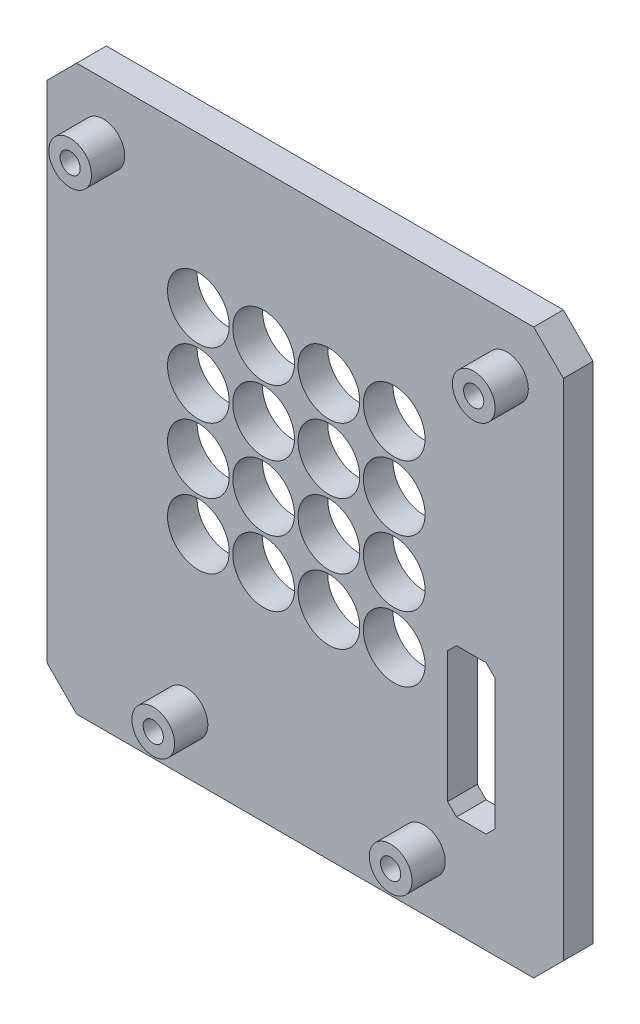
ISO-10303-21;
HEADER;
FILE_DESCRIPTION(('STEP AP214'),'2;1');
FILE_NAME('part.step','',(''),(''),'','','');
FILE_SCHEMA(('AUTOMOTIVE_DESIGN { 1 0 10303 214 1 1 1 1 }'));
ENDSEC;
DATA;
#1=APPLICATION_CONTEXT('core data for automotive mechanical design processes');
#2=APPLICATION_PROTOCOL_DEFINITION('international standard','automotive_design',2000,#1);
#3=PRODUCT_CONTEXT('',#1,'mechanical');
#4=PRODUCT('Part','Part','',(#3));
#5=PRODUCT_RELATED_PRODUCT_CATEGORY('part','',(#4));
#6=PRODUCT_DEFINITION_FORMATION('','',#4);
#7=PRODUCT_DEFINITION_CONTEXT('part definition',#1,'design');
#8=PRODUCT_DEFINITION('design','',#6,#7);
#9=PRODUCT_DEFINITION_SHAPE('','',#8);
#10=(LENGTH_UNIT() NAMED_UNIT(*) SI_UNIT(.MILLI.,.METRE.));
#11=(NAMED_UNIT(*) PLANE_ANGLE_UNIT() SI_UNIT($,.RADIAN.));
#12=(NAMED_UNIT(*) SI_UNIT($,.STERADIAN.) SOLID_ANGLE_UNIT());
#13=UNCERTAINTY_MEASURE_WITH_UNIT(LENGTH_MEASURE(1.E-05),#10,'distance_accuracy_value','');
#14=(GEOMETRIC_REPRESENTATION_CONTEXT(3) GLOBAL_UNCERTAINTY_ASSIGNED_CONTEXT((#13)) GLOBAL_UNIT_ASSIGNED_CONTEXT((#10,
#11,#12)) REPRESENTATION_CONTEXT('',''));
#15=CARTESIAN_POINT('',(0.,0.,0.));
#16=DIRECTION('',(0.,0.,1.));
#17=DIRECTION('',(1.,0.,0.));
#18=AXIS2_PLACEMENT_3D('',#15,#16,#17);
#19=CARTESIAN_POINT('',(0.,0.,5.));
#20=DIRECTION('',(0.,0.,1.));
#21=DIRECTION('',(1.,0.,0.));
#22=AXIS2_PLACEMENT_3D('',#19,#20,#21);
#23=PLANE('',#22);
#24=CARTESIAN_POINT('',(21.5,-43.5,5.));
#25=DIRECTION('',(0.,0.,1.));
#26=DIRECTION('',(1.,0.,0.));
#27=AXIS2_PLACEMENT_3D('',#24,#25,#26);
#28=CIRCLE('',#27,3.6);
#29=CARTESIAN_POINT('',(25.1,-43.5,5.));
#30=VERTEX_POINT('',#29);
#31=EDGE_CURVE('E615',#30,#30,#28,.T.);
#32=ORIENTED_EDGE('',*,*,#31,.F.);
#33=EDGE_LOOP('',(#32));
#34=FACE_BOUND('',#33,.T.);
#35=CARTESIAN_POINT('',(35.5,32.5,5.));
#36=DIRECTION('',(0.,0.,1.));
#37=DIRECTION('',(1.,0.,0.));
#38=AXIS2_PLACEMENT_3D('',#35,#36,#37);
#39=CIRCLE('',#38,3.6);
#40=CARTESIAN_POINT('',(39.1,32.5,5.));
#41=VERTEX_POINT('',#40);
#42=EDGE_CURVE('E611',#41,#41,#39,.T.);
#43=ORIENTED_EDGE('',*,*,#42,.F.);
#44=EDGE_LOOP('',(#43));
#45=FACE_BOUND('',#44,.T.);
#46=CARTESIAN_POINT('',(5.5,16.5,5.));
#47=DIRECTION('',(0.,0.,1.));
#48=DIRECTION('',(1.,0.,0.));
#49=AXIS2_PLACEMENT_3D('',#46,#47,#48);
#50=CIRCLE('',#49,5.2);
#51=CARTESIAN_POINT('',(10.7,16.5,5.));
#52=VERTEX_POINT('',#51);
#53=EDGE_CURVE('E242',#52,#52,#50,.T.);
#54=ORIENTED_EDGE('',*,*,#53,.F.);
#55=EDGE_LOOP('',(#54));
#56=FACE_BOUND('',#55,.T.);
#57=CARTESIAN_POINT('',(-16.5,16.5,5.));
#58=DIRECTION('',(0.,0.,1.));
#59=DIRECTION('',(1.,0.,0.));
#60=AXIS2_PLACEMENT_3D('',#57,#58,#59);
#61=CIRCLE('',#60,5.2);
#62=CARTESIAN_POINT('',(-11.3,16.5,5.));
#63=VERTEX_POINT('',#62);
#64=EDGE_CURVE('E254',#63,#63,#61,.T.);
#65=ORIENTED_EDGE('',*,*,#64,.F.);
#66=EDGE_LOOP('',(#65));
#67=FACE_BOUND('',#66,.T.);
#68=CARTESIAN_POINT('',(5.5,5.5,5.));
#69=DIRECTION('',(0.,0.,1.));
#70=DIRECTION('',(1.,0.,0.));
#71=AXIS2_PLACEMENT_3D('',#68,#69,#70);
#72=CIRCLE('',#71,5.2);
#73=CARTESIAN_POINT('',(10.7,5.5,5.));
#74=VERTEX_POINT('',#73);
#75=EDGE_CURVE('E266',#74,#74,#72,.T.);
#76=ORIENTED_EDGE('',*,*,#75,.F.);
#77=EDGE_LOOP('',(#76));
#78=FACE_BOUND('',#77,.T.);
#79=CARTESIAN_POINT('',(-16.5,5.5,5.));
#80=DIRECTION('',(0.,0.,1.));
#81=DIRECTION('',(1.,0.,0.));
#82=AXIS2_PLACEMENT_3D('',#79,#80,#81);
#83=CIRCLE('',#82,5.2);
#84=CARTESIAN_POINT('',(-11.3,5.5,5.));
#85=VERTEX_POINT('',#84);
#86=EDGE_CURVE('E278',#85,#85,#83,.T.);
#87=ORIENTED_EDGE('',*,*,#86,.F.);
#88=EDGE_LOOP('',(#87));
#89=FACE_BOUND('',#88,.T.);
#90=CARTESIAN_POINT('',(5.5,-5.5,5.));
#91=DIRECTION('',(0.,0.,1.));
#92=DIRECTION('',(1.,0.,0.));
#93=AXIS2_PLACEMENT_3D('',#90,#91,#92);
#94=CIRCLE('',#93,5.2);
#95=CARTESIAN_POINT('',(10.7,-5.5,5.));
#96=VERTEX_POINT('',#95);
#97=EDGE_CURVE('E290',#96,#96,#94,.T.);
#98=ORIENTED_EDGE('',*,*,#97,.F.);
#99=EDGE_LOOP('',(#98));
#100=FACE_BOUND('',#99,.T.);
#101=CARTESIAN_POINT('',(-16.5,-5.5,5.));
#102=DIRECTION('',(0.,0.,1.));
#103=DIRECTION('',(1.,0.,0.));
#104=AXIS2_PLACEMENT_3D('',#101,#102,#103);
#105=CIRCLE('',#104,5.2);
#106=CARTESIAN_POINT('',(-11.3,-5.5,5.));
#107=VERTEX_POINT('',#106);
#108=EDGE_CURVE('E302',#107,#107,#105,.T.);
#109=ORIENTED_EDGE('',*,*,#108,.F.);
#110=EDGE_LOOP('',(#109));
#111=FACE_BOUND('',#110,.T.);
#112=CARTESIAN_POINT('',(5.5,-16.5,5.));
#113=DIRECTION('',(0.,0.,1.));
#114=DIRECTION('',(1.,0.,0.));
#115=AXIS2_PLACEMENT_3D('',#112,#113,#114);
#116=CIRCLE('',#115,5.2);
#117=CARTESIAN_POINT('',(10.7,-16.5,5.));
#118=VERTEX_POINT('',#117);
#119=EDGE_CURVE('E314',#118,#118,#116,.T.);
#120=ORIENTED_EDGE('',*,*,#119,.F.);
#121=EDGE_LOOP('',(#120));
#122=FACE_BOUND('',#121,.T.);
#123=CARTESIAN_POINT('',(-16.5,-16.5,5.));
#124=DIRECTION('',(0.,0.,1.));
#125=DIRECTION('',(1.,0.,0.));
#126=AXIS2_PLACEMENT_3D('',#123,#124,#125);
#127=CIRCLE('',#126,5.2);
#128=CARTESIAN_POINT('',(-11.3,-16.5,5.));
#129=VERTEX_POINT('',#128);
#130=EDGE_CURVE('E326',#129,#129,#127,.T.);
#131=ORIENTED_EDGE('',*,*,#130,.F.);
#132=EDGE_LOOP('',(#131));
#133=FACE_BOUND('',#132,.T.);
#134=DIRECTION('',(0.707106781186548,-0.707106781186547,0.));
#135=VECTOR('',#134,1.);
#136=CARTESIAN_POINT('',(-42.,-48.,5.));
#137=LINE('',#136,#135);
#138=CARTESIAN_POINT('',(-42.,-48.,5.));
#139=VERTEX_POINT('',#138);
#140=CARTESIAN_POINT('',(-37.,-53.,5.));
#141=VERTEX_POINT('',#140);
#142=EDGE_CURVE('E332',#139,#141,#137,.T.);
#143=ORIENTED_EDGE('',*,*,#142,.T.);
#144=DIRECTION('',(1.,0.,0.));
#145=VECTOR('',#144,1.);
#146=CARTESIAN_POINT('',(-37.,-53.,5.));
#147=LINE('',#146,#145);
#148=CARTESIAN_POINT('',(40.,-53.,5.));
#149=VERTEX_POINT('',#148);
#150=EDGE_CURVE('E335',#141,#149,#147,.T.);
#151=ORIENTED_EDGE('',*,*,#150,.T.);
#152=DIRECTION('',(0.707106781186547,0.707106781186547,0.));
#153=VECTOR('',#152,1.);
#154=CARTESIAN_POINT('',(40.,-53.,5.));
#155=LINE('',#154,#153);
#156=CARTESIAN_POINT('',(45.,-48.,5.));
#157=VERTEX_POINT('',#156);
#158=EDGE_CURVE('E338',#149,#157,#155,.T.);
#159=ORIENTED_EDGE('',*,*,#158,.T.);
#160=DIRECTION('',(0.,1.,0.));
#161=VECTOR('',#160,1.);
#162=CARTESIAN_POINT('',(45.,-48.,5.));
#163=LINE('',#162,#161);
#164=CARTESIAN_POINT('',(45.,37.,5.));
#165=VERTEX_POINT('',#164);
#166=EDGE_CURVE('E340',#157,#165,#163,.T.);
#167=ORIENTED_EDGE('',*,*,#166,.T.);
#168=DIRECTION('',(-0.707106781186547,0.707106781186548,0.));
#169=VECTOR('',#168,1.);
#170=CARTESIAN_POINT('',(45.,37.,5.));
#171=LINE('',#170,#169);
#172=CARTESIAN_POINT('',(40.,42.,5.));
#173=VERTEX_POINT('',#172);
#174=EDGE_CURVE('E342',#165,#173,#171,.T.);
#175=ORIENTED_EDGE('',*,*,#174,.T.);
#176=DIRECTION('',(-1.,0.,0.));
#177=VECTOR('',#176,1.);
#178=CARTESIAN_POINT('',(40.,42.,5.));
#179=LINE('',#178,#177);
#180=CARTESIAN_POINT('',(-37.,42.,5.));
#181=VERTEX_POINT('',#180);
#182=EDGE_CURVE('E344',#173,#181,#179,.T.);
#183=ORIENTED_EDGE('',*,*,#182,.T.);
#184=DIRECTION('',(-0.707106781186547,-0.707106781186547,0.));
#185=VECTOR('',#184,1.);
#186=CARTESIAN_POINT('',(-37.,42.,5.));
#187=LINE('',#186,#185);
#188=CARTESIAN_POINT('',(-42.,37.,5.));
#189=VERTEX_POINT('',#188);
#190=EDGE_CURVE('E346',#181,#189,#187,.T.);
#191=ORIENTED_EDGE('',*,*,#190,.T.);
#192=DIRECTION('',(0.,-1.,0.));
#193=VECTOR('',#192,1.);
#194=CARTESIAN_POINT('',(-42.,37.,5.));
#195=LINE('',#194,#193);
#196=EDGE_CURVE('E348',#189,#139,#195,.T.);
#197=ORIENTED_EDGE('',*,*,#196,.T.);
#198=EDGE_LOOP('',(#143,#151,#159,#167,#175,#183,#191,#197));
#199=FACE_BOUND('',#198,.T.);
#200=CARTESIAN_POINT('',(-5.5,-16.5,5.));
#201=DIRECTION('',(0.,0.,1.));
#202=DIRECTION('',(1.,0.,0.));
#203=AXIS2_PLACEMENT_3D('',#200,#201,#202);
#204=CIRCLE('',#203,5.2);
#205=CARTESIAN_POINT('',(-0.3,-16.5,5.));
#206=VERTEX_POINT('',#205);
#207=EDGE_CURVE('E320',#206,#206,#204,.T.);
#208=ORIENTED_EDGE('',*,*,#207,.F.);
#209=EDGE_LOOP('',(#208));
#210=FACE_BOUND('',#209,.T.);
#211=CARTESIAN_POINT('',(16.5,-16.5,5.));
#212=DIRECTION('',(0.,0.,1.));
#213=DIRECTION('',(1.,0.,0.));
#214=AXIS2_PLACEMENT_3D('',#211,#212,#213);
#215=CIRCLE('',#214,5.2);
#216=CARTESIAN_POINT('',(21.7,-16.5,5.));
#217=VERTEX_POINT('',#216);
#218=EDGE_CURVE('E308',#217,#217,#215,.T.);
#219=ORIENTED_EDGE('',*,*,#218,.F.);
#220=EDGE_LOOP('',(#219));
#221=FACE_BOUND('',#220,.T.);
#222=CARTESIAN_POINT('',(-5.5,-5.5,5.));
#223=DIRECTION('',(0.,0.,1.));
#224=DIRECTION('',(1.,0.,0.));
#225=AXIS2_PLACEMENT_3D('',#222,#223,#224);
#226=CIRCLE('',#225,5.2);
#227=CARTESIAN_POINT('',(-0.3,-5.5,5.));
#228=VERTEX_POINT('',#227);
#229=EDGE_CURVE('E296',#228,#228,#226,.T.);
#230=ORIENTED_EDGE('',*,*,#229,.F.);
#231=EDGE_LOOP('',(#230));
#232=FACE_BOUND('',#231,.T.);
#233=CARTESIAN_POINT('',(16.5,-5.5,5.));
#234=DIRECTION('',(0.,0.,1.));
#235=DIRECTION('',(1.,0.,0.));
#236=AXIS2_PLACEMENT_3D('',#233,#234,#235);
#237=CIRCLE('',#236,5.2);
#238=CARTESIAN_POINT('',(21.7,-5.5,5.));
#239=VERTEX_POINT('',#238);
#240=EDGE_CURVE('E284',#239,#239,#237,.T.);
#241=ORIENTED_EDGE('',*,*,#240,.F.);
#242=EDGE_LOOP('',(#241));
#243=FACE_BOUND('',#242,.T.);
#244=CARTESIAN_POINT('',(-5.5,5.5,5.));
#245=DIRECTION('',(0.,0.,1.));
#246=DIRECTION('',(1.,0.,0.));
#247=AXIS2_PLACEMENT_3D('',#244,#245,#246);
#248=CIRCLE('',#247,5.2);
#249=CARTESIAN_POINT('',(-0.3,5.5,5.));
#250=VERTEX_POINT('',#249);
#251=EDGE_CURVE('E272',#250,#250,#248,.T.);
#252=ORIENTED_EDGE('',*,*,#251,.F.);
#253=EDGE_LOOP('',(#252));
#254=FACE_BOUND('',#253,.T.);
#255=CARTESIAN_POINT('',(16.5,5.5,5.));
#256=DIRECTION('',(0.,0.,1.));
#257=DIRECTION('',(1.,0.,0.));
#258=AXIS2_PLACEMENT_3D('',#255,#256,#257);
#259=CIRCLE('',#258,5.2);
#260=CARTESIAN_POINT('',(21.7,5.5,5.));
#261=VERTEX_POINT('',#260);
#262=EDGE_CURVE('E260',#261,#261,#259,.T.);
#263=ORIENTED_EDGE('',*,*,#262,.F.);
#264=EDGE_LOOP('',(#263));
#265=FACE_BOUND('',#264,.T.);
#266=CARTESIAN_POINT('',(-5.5,16.5,5.));
#267=DIRECTION('',(0.,0.,1.));
#268=DIRECTION('',(1.,0.,0.));
#269=AXIS2_PLACEMENT_3D('',#266,#267,#268);
#270=CIRCLE('',#269,5.2);
#271=CARTESIAN_POINT('',(-0.3,16.5,5.));
#272=VERTEX_POINT('',#271);
#273=EDGE_CURVE('E248',#272,#272,#270,.T.);
#274=ORIENTED_EDGE('',*,*,#273,.F.);
#275=EDGE_LOOP('',(#274));
#276=FACE_BOUND('',#275,.T.);
#277=CARTESIAN_POINT('',(16.5,16.5,5.));
#278=DIRECTION('',(0.,0.,1.));
#279=DIRECTION('',(1.,0.,0.));
#280=AXIS2_PLACEMENT_3D('',#277,#278,#279);
#281=CIRCLE('',#280,5.2);
#282=CARTESIAN_POINT('',(21.7,16.5,5.));
#283=VERTEX_POINT('',#282);
#284=EDGE_CURVE('E236',#283,#283,#281,.T.);
#285=ORIENTED_EDGE('',*,*,#284,.F.);
#286=EDGE_LOOP('',(#285));
#287=FACE_BOUND('',#286,.T.);
#288=DIRECTION('',(1.,0.,0.));
#289=VECTOR('',#288,1.);
#290=CARTESIAN_POINT('',(27.,-36.,5.));
#291=LINE('',#290,#289);
#292=CARTESIAN_POINT('',(27.,-36.,5.));
#293=VERTEX_POINT('',#292);
#294=CARTESIAN_POINT('',(32.,-36.,5.));
#295=VERTEX_POINT('',#294);
#296=EDGE_CURVE('E164',#293,#295,#291,.T.);
#297=ORIENTED_EDGE('',*,*,#296,.F.);
#298=DIRECTION('',(0.707106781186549,-0.707106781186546,0.));
#299=VECTOR('',#298,1.);
#300=CARTESIAN_POINT('',(25.5,-34.5,5.));
#301=LINE('',#300,#299);
#302=CARTESIAN_POINT('',(25.5,-34.5,5.));
#303=VERTEX_POINT('',#302);
#304=EDGE_CURVE('E156',#303,#293,#301,.T.);
#305=ORIENTED_EDGE('',*,*,#304,.F.);
#306=DIRECTION('',(0.,-1.,0.));
#307=VECTOR('',#306,1.);
#308=CARTESIAN_POINT('',(25.5,-12.5,5.));
#309=LINE('',#308,#307);
#310=CARTESIAN_POINT('',(25.5,-12.5,5.));
#311=VERTEX_POINT('',#310);
#312=EDGE_CURVE('E191',#311,#303,#309,.T.);
#313=ORIENTED_EDGE('',*,*,#312,.F.);
#314=DIRECTION('',(-0.707106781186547,-0.707106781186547,0.));
#315=VECTOR('',#314,1.);
#316=CARTESIAN_POINT('',(27.,-11.,5.));
#317=LINE('',#316,#315);
#318=CARTESIAN_POINT('',(27.,-11.,5.));
#319=VERTEX_POINT('',#318);
#320=EDGE_CURVE('E189',#319,#311,#317,.T.);
#321=ORIENTED_EDGE('',*,*,#320,.F.);
#322=DIRECTION('',(-1.,0.,0.));
#323=VECTOR('',#322,1.);
#324=CARTESIAN_POINT('',(32.,-11.,5.));
#325=LINE('',#324,#323);
#326=CARTESIAN_POINT('',(32.,-11.,5.));
#327=VERTEX_POINT('',#326);
#328=EDGE_CURVE('E187',#327,#319,#325,.T.);
#329=ORIENTED_EDGE('',*,*,#328,.F.);
#330=DIRECTION('',(-0.707106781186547,0.707106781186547,0.));
#331=VECTOR('',#330,1.);
#332=CARTESIAN_POINT('',(33.5,-12.5,5.));
#333=LINE('',#332,#331);
#334=CARTESIAN_POINT('',(33.5,-12.5,5.));
#335=VERTEX_POINT('',#334);
#336=EDGE_CURVE('E185',#335,#327,#333,.T.);
#337=ORIENTED_EDGE('',*,*,#336,.F.);
#338=DIRECTION('',(0.,1.,0.));
#339=VECTOR('',#338,1.);
#340=CARTESIAN_POINT('',(33.5,-34.5,5.));
#341=LINE('',#340,#339);
#342=CARTESIAN_POINT('',(33.5,-34.5,5.));
#343=VERTEX_POINT('',#342);
#344=EDGE_CURVE('E180',#343,#335,#341,.T.);
#345=ORIENTED_EDGE('',*,*,#344,.F.);
#346=DIRECTION('',(0.707106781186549,0.707106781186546,0.));
#347=VECTOR('',#346,1.);
#348=CARTESIAN_POINT('',(32.,-36.,5.));
#349=LINE('',#348,#347);
#350=EDGE_CURVE('E178',#295,#343,#349,.T.);
#351=ORIENTED_EDGE('',*,*,#350,.F.);
#352=EDGE_LOOP('',(#297,#305,#313,#321,#329,#337,#345,#351));
#353=FACE_BOUND('',#352,.T.);
#354=CARTESIAN_POINT('',(-18.5,-43.5,5.));
#355=DIRECTION('',(0.,0.,1.));
#356=DIRECTION('',(1.,0.,0.));
#357=AXIS2_PLACEMENT_3D('',#354,#355,#356);
#358=CIRCLE('',#357,3.6);
#359=CARTESIAN_POINT('',(-14.9,-43.5,5.));
#360=VERTEX_POINT('',#359);
#361=EDGE_CURVE('E631',#360,#360,#358,.T.);
#362=ORIENTED_EDGE('',*,*,#361,.F.);
#363=EDGE_LOOP('',(#362));
#364=FACE_BOUND('',#363,.T.);
#365=CARTESIAN_POINT('',(-32.5,32.5,5.));
#366=DIRECTION('',(0.,0.,1.));
#367=DIRECTION('',(1.,0.,0.));
#368=AXIS2_PLACEMENT_3D('',#365,#366,#367);
#369=CIRCLE('',#368,3.6);
#370=CARTESIAN_POINT('',(-28.9,32.5,5.));
#371=VERTEX_POINT('',#370);
#372=EDGE_CURVE('E605',#371,#371,#369,.T.);
#373=ORIENTED_EDGE('',*,*,#372,.F.);
#374=EDGE_LOOP('',(#373));
#375=FACE_BOUND('',#374,.T.);
#376=ADVANCED_FACE('F43',(#34,#45,#56,#67,#78,#89,#100,#111,#122,#133,#199,#210,#221,#232,#243,
#254,#265,#276,#287,#353,#364,#375),#23,.T.);
#377=CARTESIAN_POINT('',(0.,0.,0.));
#378=DIRECTION('',(0.,0.,1.));
#379=DIRECTION('',(1.,0.,0.));
#380=AXIS2_PLACEMENT_3D('',#377,#378,#379);
#381=PLANE('',#380);
#382=CARTESIAN_POINT('',(21.5,-43.5,0.));
#383=DIRECTION('',(0.,0.,1.));
#384=DIRECTION('',(1.,0.,0.));
#385=AXIS2_PLACEMENT_3D('',#382,#383,#384);
#386=CIRCLE('',#385,1.7);
#387=CARTESIAN_POINT('',(23.2,-43.5,0.));
#388=VERTEX_POINT('',#387);
#389=EDGE_CURVE('E172',#388,#388,#386,.T.);
#390=ORIENTED_EDGE('',*,*,#389,.T.);
#391=EDGE_LOOP('',(#390));
#392=FACE_BOUND('',#391,.T.);
#393=CARTESIAN_POINT('',(-18.5,-43.5,0.));
#394=DIRECTION('',(0.,0.,1.));
#395=DIRECTION('',(1.,0.,0.));
#396=AXIS2_PLACEMENT_3D('',#393,#394,#395);
#397=CIRCLE('',#396,1.7);
#398=CARTESIAN_POINT('',(-16.8,-43.5,0.));
#399=VERTEX_POINT('',#398);
#400=EDGE_CURVE('E226',#399,#399,#397,.T.);
#401=ORIENTED_EDGE('',*,*,#400,.T.);
#402=EDGE_LOOP('',(#401));
#403=FACE_BOUND('',#402,.T.);
#404=CARTESIAN_POINT('',(35.5,32.5,0.));
#405=DIRECTION('',(0.,0.,1.));
#406=DIRECTION('',(1.,0.,0.));
#407=AXIS2_PLACEMENT_3D('',#404,#405,#406);
#408=CIRCLE('',#407,1.7);
#409=CARTESIAN_POINT('',(37.2,32.5,0.));
#410=VERTEX_POINT('',#409);
#411=EDGE_CURVE('E229',#410,#410,#408,.T.);
#412=ORIENTED_EDGE('',*,*,#411,.T.);
#413=EDGE_LOOP('',(#412));
#414=FACE_BOUND('',#413,.T.);
#415=CARTESIAN_POINT('',(-32.5,32.5,0.));
#416=DIRECTION('',(0.,0.,1.));
#417=DIRECTION('',(1.,0.,0.));
#418=AXIS2_PLACEMENT_3D('',#415,#416,#417);
#419=CIRCLE('',#418,1.7);
#420=CARTESIAN_POINT('',(-30.8,32.5,0.));
#421=VERTEX_POINT('',#420);
#422=EDGE_CURVE('E232',#421,#421,#419,.T.);
#423=ORIENTED_EDGE('',*,*,#422,.T.);
#424=EDGE_LOOP('',(#423));
#425=FACE_BOUND('',#424,.T.);
#426=CARTESIAN_POINT('',(16.5,16.5,0.));
#427=DIRECTION('',(0.,0.,1.));
#428=DIRECTION('',(1.,0.,0.));
#429=AXIS2_PLACEMENT_3D('',#426,#427,#428);
#430=CIRCLE('',#429,5.2);
#431=CARTESIAN_POINT('',(21.7,16.5,0.));
#432=VERTEX_POINT('',#431);
#433=EDGE_CURVE('E235',#432,#432,#430,.T.);
#434=ORIENTED_EDGE('',*,*,#433,.T.);
#435=EDGE_LOOP('',(#434));
#436=FACE_BOUND('',#435,.T.);
#437=CARTESIAN_POINT('',(5.5,16.5,0.));
#438=DIRECTION('',(0.,0.,1.));
#439=DIRECTION('',(1.,0.,0.));
#440=AXIS2_PLACEMENT_3D('',#437,#438,#439);
#441=CIRCLE('',#440,5.2);
#442=CARTESIAN_POINT('',(10.7,16.5,0.));
#443=VERTEX_POINT('',#442);
#444=EDGE_CURVE('E239',#443,#443,#441,.T.);
#445=ORIENTED_EDGE('',*,*,#444,.T.);
#446=EDGE_LOOP('',(#445));
#447=FACE_BOUND('',#446,.T.);
#448=CARTESIAN_POINT('',(-5.5,16.5,0.));
#449=DIRECTION('',(0.,0.,1.));
#450=DIRECTION('',(1.,0.,0.));
#451=AXIS2_PLACEMENT_3D('',#448,#449,#450);
#452=CIRCLE('',#451,5.2);
#453=CARTESIAN_POINT('',(-0.3,16.5,0.));
#454=VERTEX_POINT('',#453);
#455=EDGE_CURVE('E245',#454,#454,#452,.T.);
#456=ORIENTED_EDGE('',*,*,#455,.T.);
#457=EDGE_LOOP('',(#456));
#458=FACE_BOUND('',#457,.T.);
#459=CARTESIAN_POINT('',(-16.5,16.5,0.));
#460=DIRECTION('',(0.,0.,1.));
#461=DIRECTION('',(1.,0.,0.));
#462=AXIS2_PLACEMENT_3D('',#459,#460,#461);
#463=CIRCLE('',#462,5.2);
#464=CARTESIAN_POINT('',(-11.3,16.5,0.));
#465=VERTEX_POINT('',#464);
#466=EDGE_CURVE('E251',#465,#465,#463,.T.);
#467=ORIENTED_EDGE('',*,*,#466,.T.);
#468=EDGE_LOOP('',(#467));
#469=FACE_BOUND('',#468,.T.);
#470=CARTESIAN_POINT('',(16.5,5.5,0.));
#471=DIRECTION('',(0.,0.,1.));
#472=DIRECTION('',(1.,0.,0.));
#473=AXIS2_PLACEMENT_3D('',#470,#471,#472);
#474=CIRCLE('',#473,5.2);
#475=CARTESIAN_POINT('',(21.7,5.5,0.));
#476=VERTEX_POINT('',#475);
#477=EDGE_CURVE('E257',#476,#476,#474,.T.);
#478=ORIENTED_EDGE('',*,*,#477,.T.);
#479=EDGE_LOOP('',(#478));
#480=FACE_BOUND('',#479,.T.);
#481=CARTESIAN_POINT('',(5.5,5.5,0.));
#482=DIRECTION('',(0.,0.,1.));
#483=DIRECTION('',(1.,0.,0.));
#484=AXIS2_PLACEMENT_3D('',#481,#482,#483);
#485=CIRCLE('',#484,5.2);
#486=CARTESIAN_POINT('',(10.7,5.5,0.));
#487=VERTEX_POINT('',#486);
#488=EDGE_CURVE('E263',#487,#487,#485,.T.);
#489=ORIENTED_EDGE('',*,*,#488,.T.);
#490=EDGE_LOOP('',(#489));
#491=FACE_BOUND('',#490,.T.);
#492=CARTESIAN_POINT('',(-5.5,5.5,0.));
#493=DIRECTION('',(0.,0.,1.));
#494=DIRECTION('',(1.,0.,0.));
#495=AXIS2_PLACEMENT_3D('',#492,#493,#494);
#496=CIRCLE('',#495,5.2);
#497=CARTESIAN_POINT('',(-0.3,5.5,0.));
#498=VERTEX_POINT('',#497);
#499=EDGE_CURVE('E269',#498,#498,#496,.T.);
#500=ORIENTED_EDGE('',*,*,#499,.T.);
#501=EDGE_LOOP('',(#500));
#502=FACE_BOUND('',#501,.T.);
#503=CARTESIAN_POINT('',(-16.5,5.5,0.));
#504=DIRECTION('',(0.,0.,1.));
#505=DIRECTION('',(1.,0.,0.));
#506=AXIS2_PLACEMENT_3D('',#503,#504,#505);
#507=CIRCLE('',#506,5.2);
#508=CARTESIAN_POINT('',(-11.3,5.5,0.));
#509=VERTEX_POINT('',#508);
#510=EDGE_CURVE('E275',#509,#509,#507,.T.);
#511=ORIENTED_EDGE('',*,*,#510,.T.);
#512=EDGE_LOOP('',(#511));
#513=FACE_BOUND('',#512,.T.);
#514=CARTESIAN_POINT('',(16.5,-5.5,0.));
#515=DIRECTION('',(0.,0.,1.));
#516=DIRECTION('',(1.,0.,0.));
#517=AXIS2_PLACEMENT_3D('',#514,#515,#516);
#518=CIRCLE('',#517,5.2);
#519=CARTESIAN_POINT('',(21.7,-5.5,0.));
#520=VERTEX_POINT('',#519);
#521=EDGE_CURVE('E281',#520,#520,#518,.T.);
#522=ORIENTED_EDGE('',*,*,#521,.T.);
#523=EDGE_LOOP('',(#522));
#524=FACE_BOUND('',#523,.T.);
#525=CARTESIAN_POINT('',(5.5,-5.5,0.));
#526=DIRECTION('',(0.,0.,1.));
#527=DIRECTION('',(1.,0.,0.));
#528=AXIS2_PLACEMENT_3D('',#525,#526,#527);
#529=CIRCLE('',#528,5.2);
#530=CARTESIAN_POINT('',(10.7,-5.5,0.));
#531=VERTEX_POINT('',#530);
#532=EDGE_CURVE('E287',#531,#531,#529,.T.);
#533=ORIENTED_EDGE('',*,*,#532,.T.);
#534=EDGE_LOOP('',(#533));
#535=FACE_BOUND('',#534,.T.);
#536=CARTESIAN_POINT('',(-5.5,-5.5,0.));
#537=DIRECTION('',(0.,0.,1.));
#538=DIRECTION('',(1.,0.,0.));
#539=AXIS2_PLACEMENT_3D('',#536,#537,#538);
#540=CIRCLE('',#539,5.2);
#541=CARTESIAN_POINT('',(-0.3,-5.5,0.));
#542=VERTEX_POINT('',#541);
#543=EDGE_CURVE('E293',#542,#542,#540,.T.);
#544=ORIENTED_EDGE('',*,*,#543,.T.);
#545=EDGE_LOOP('',(#544));
#546=FACE_BOUND('',#545,.T.);
#547=CARTESIAN_POINT('',(-16.5,-5.5,0.));
#548=DIRECTION('',(0.,0.,1.));
#549=DIRECTION('',(1.,0.,0.));
#550=AXIS2_PLACEMENT_3D('',#547,#548,#549);
#551=CIRCLE('',#550,5.2);
#552=CARTESIAN_POINT('',(-11.3,-5.5,0.));
#553=VERTEX_POINT('',#552);
#554=EDGE_CURVE('E299',#553,#553,#551,.T.);
#555=ORIENTED_EDGE('',*,*,#554,.T.);
#556=EDGE_LOOP('',(#555));
#557=FACE_BOUND('',#556,.T.);
#558=CARTESIAN_POINT('',(16.5,-16.5,0.));
#559=DIRECTION('',(0.,0.,1.));
#560=DIRECTION('',(1.,0.,0.));
#561=AXIS2_PLACEMENT_3D('',#558,#559,#560);
#562=CIRCLE('',#561,5.2);
#563=CARTESIAN_POINT('',(21.7,-16.5,0.));
#564=VERTEX_POINT('',#563);
#565=EDGE_CURVE('E305',#564,#564,#562,.T.);
#566=ORIENTED_EDGE('',*,*,#565,.T.);
#567=EDGE_LOOP('',(#566));
#568=FACE_BOUND('',#567,.T.);
#569=CARTESIAN_POINT('',(5.5,-16.5,0.));
#570=DIRECTION('',(0.,0.,1.));
#571=DIRECTION('',(1.,0.,0.));
#572=AXIS2_PLACEMENT_3D('',#569,#570,#571);
#573=CIRCLE('',#572,5.2);
#574=CARTESIAN_POINT('',(10.7,-16.5,0.));
#575=VERTEX_POINT('',#574);
#576=EDGE_CURVE('E311',#575,#575,#573,.T.);
#577=ORIENTED_EDGE('',*,*,#576,.T.);
#578=EDGE_LOOP('',(#577));
#579=FACE_BOUND('',#578,.T.);
#580=CARTESIAN_POINT('',(-5.5,-16.5,0.));
#581=DIRECTION('',(0.,0.,1.));
#582=DIRECTION('',(1.,0.,0.));
#583=AXIS2_PLACEMENT_3D('',#580,#581,#582);
#584=CIRCLE('',#583,5.2);
#585=CARTESIAN_POINT('',(-0.3,-16.5,0.));
#586=VERTEX_POINT('',#585);
#587=EDGE_CURVE('E317',#586,#586,#584,.T.);
#588=ORIENTED_EDGE('',*,*,#587,.T.);
#589=EDGE_LOOP('',(#588));
#590=FACE_BOUND('',#589,.T.);
#591=CARTESIAN_POINT('',(-16.5,-16.5,0.));
#592=DIRECTION('',(0.,0.,1.));
#593=DIRECTION('',(1.,0.,0.));
#594=AXIS2_PLACEMENT_3D('',#591,#592,#593);
#595=CIRCLE('',#594,5.2);
#596=CARTESIAN_POINT('',(-11.3,-16.5,0.));
#597=VERTEX_POINT('',#596);
#598=EDGE_CURVE('E323',#597,#597,#595,.T.);
#599=ORIENTED_EDGE('',*,*,#598,.T.);
#600=EDGE_LOOP('',(#599));
#601=FACE_BOUND('',#600,.T.);
#602=DIRECTION('',(0.707106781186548,-0.707106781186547,0.));
#603=VECTOR('',#602,1.);
#604=CARTESIAN_POINT('',(-42.,-48.,0.));
#605=LINE('',#604,#603);
#606=CARTESIAN_POINT('',(-42.,-48.,0.));
#607=VERTEX_POINT('',#606);
#608=CARTESIAN_POINT('',(-37.,-53.,0.));
#609=VERTEX_POINT('',#608);
#610=EDGE_CURVE('E329',#607,#609,#605,.T.);
#611=ORIENTED_EDGE('',*,*,#610,.F.);
#612=DIRECTION('',(0.,-1.,0.));
#613=VECTOR('',#612,1.);
#614=CARTESIAN_POINT('',(-42.,37.,0.));
#615=LINE('',#614,#613);
#616=CARTESIAN_POINT('',(-42.,37.,0.));
#617=VERTEX_POINT('',#616);
#618=EDGE_CURVE('E336',#617,#607,#615,.T.);
#619=ORIENTED_EDGE('',*,*,#618,.F.);
#620=DIRECTION('',(-0.707106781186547,-0.707106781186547,0.));
#621=VECTOR('',#620,1.);
#622=CARTESIAN_POINT('',(-37.,42.,0.));
#623=LINE('',#622,#621);
#624=CARTESIAN_POINT('',(-37.,42.,0.));
#625=VERTEX_POINT('',#624);
#626=EDGE_CURVE('E363',#625,#617,#623,.T.);
#627=ORIENTED_EDGE('',*,*,#626,.F.);
#628=DIRECTION('',(-1.,0.,0.));
#629=VECTOR('',#628,1.);
#630=CARTESIAN_POINT('',(40.,42.,0.));
#631=LINE('',#630,#629);
#632=CARTESIAN_POINT('',(40.,42.,0.));
#633=VERTEX_POINT('',#632);
#634=EDGE_CURVE('E361',#633,#625,#631,.T.);
#635=ORIENTED_EDGE('',*,*,#634,.F.);
#636=DIRECTION('',(-0.707106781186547,0.707106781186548,0.));
#637=VECTOR('',#636,1.);
#638=CARTESIAN_POINT('',(45.,37.,0.));
#639=LINE('',#638,#637);
#640=CARTESIAN_POINT('',(45.,37.,0.));
#641=VERTEX_POINT('',#640);
#642=EDGE_CURVE('E359',#641,#633,#639,.T.);
#643=ORIENTED_EDGE('',*,*,#642,.F.);
#644=DIRECTION('',(0.,1.,0.));
#645=VECTOR('',#644,1.);
#646=CARTESIAN_POINT('',(45.,-48.,0.));
#647=LINE('',#646,#645);
#648=CARTESIAN_POINT('',(45.,-48.,0.));
#649=VERTEX_POINT('',#648);
#650=EDGE_CURVE('E357',#649,#641,#647,.T.);
#651=ORIENTED_EDGE('',*,*,#650,.F.);
#652=DIRECTION('',(0.707106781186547,0.707106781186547,0.));
#653=VECTOR('',#652,1.);
#654=CARTESIAN_POINT('',(40.,-53.,0.));
#655=LINE('',#654,#653);
#656=CARTESIAN_POINT('',(40.,-53.,0.));
#657=VERTEX_POINT('',#656);
#658=EDGE_CURVE('E355',#657,#649,#655,.T.);
#659=ORIENTED_EDGE('',*,*,#658,.F.);
#660=DIRECTION('',(1.,0.,0.));
#661=VECTOR('',#660,1.);
#662=CARTESIAN_POINT('',(-37.,-53.,0.));
#663=LINE('',#662,#661);
#664=EDGE_CURVE('E353',#609,#657,#663,.T.);
#665=ORIENTED_EDGE('',*,*,#664,.F.);
#666=EDGE_LOOP('',(#611,#619,#627,#635,#643,#651,#659,#665));
#667=FACE_BOUND('',#666,.T.);
#668=DIRECTION('',(0.707106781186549,-0.707106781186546,0.));
#669=VECTOR('',#668,1.);
#670=CARTESIAN_POINT('',(25.5,-34.5,0.));
#671=LINE('',#670,#669);
#672=CARTESIAN_POINT('',(25.5,-34.5,0.));
#673=VERTEX_POINT('',#672);
#674=CARTESIAN_POINT('',(27.,-36.,0.));
#675=VERTEX_POINT('',#674);
#676=EDGE_CURVE('E66',#673,#675,#671,.T.);
#677=ORIENTED_EDGE('',*,*,#676,.T.);
#678=DIRECTION('',(1.,0.,0.));
#679=VECTOR('',#678,1.);
#680=CARTESIAN_POINT('',(27.,-36.,0.));
#681=LINE('',#680,#679);
#682=CARTESIAN_POINT('',(32.,-36.,0.));
#683=VERTEX_POINT('',#682);
#684=EDGE_CURVE('E171',#675,#683,#681,.T.);
#685=ORIENTED_EDGE('',*,*,#684,.T.);
#686=DIRECTION('',(0.707106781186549,0.707106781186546,0.));
#687=VECTOR('',#686,1.);
#688=CARTESIAN_POINT('',(32.,-36.,0.));
#689=LINE('',#688,#687);
#690=CARTESIAN_POINT('',(33.5,-34.5,0.));
#691=VERTEX_POINT('',#690);
#692=EDGE_CURVE('E196',#683,#691,#689,.T.);
#693=ORIENTED_EDGE('',*,*,#692,.T.);
#694=DIRECTION('',(0.,1.,0.));
#695=VECTOR('',#694,1.);
#696=CARTESIAN_POINT('',(33.5,-34.5,0.));
#697=LINE('',#696,#695);
#698=CARTESIAN_POINT('',(33.5,-12.5,0.));
#699=VERTEX_POINT('',#698);
#700=EDGE_CURVE('E199',#691,#699,#697,.T.);
#701=ORIENTED_EDGE('',*,*,#700,.T.);
#702=DIRECTION('',(-0.707106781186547,0.707106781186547,0.));
#703=VECTOR('',#702,1.);
#704=CARTESIAN_POINT('',(33.5,-12.5,0.));
#705=LINE('',#704,#703);
#706=CARTESIAN_POINT('',(32.,-11.,0.));
#707=VERTEX_POINT('',#706);
#708=EDGE_CURVE('E202',#699,#707,#705,.T.);
#709=ORIENTED_EDGE('',*,*,#708,.T.);
#710=DIRECTION('',(-1.,0.,0.));
#711=VECTOR('',#710,1.);
#712=CARTESIAN_POINT('',(32.,-11.,0.));
#713=LINE('',#712,#711);
#714=CARTESIAN_POINT('',(27.,-11.,0.));
#715=VERTEX_POINT('',#714);
#716=EDGE_CURVE('E205',#707,#715,#713,.T.);
#717=ORIENTED_EDGE('',*,*,#716,.T.);
#718=DIRECTION('',(-0.707106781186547,-0.707106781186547,0.));
#719=VECTOR('',#718,1.);
#720=CARTESIAN_POINT('',(27.,-11.,0.));
#721=LINE('',#720,#719);
#722=CARTESIAN_POINT('',(25.5,-12.5,0.));
#723=VERTEX_POINT('',#722);
#724=EDGE_CURVE('E208',#715,#723,#721,.T.);
#725=ORIENTED_EDGE('',*,*,#724,.T.);
#726=DIRECTION('',(0.,-1.,0.));
#727=VECTOR('',#726,1.);
#728=CARTESIAN_POINT('',(25.5,-12.5,0.));
#729=LINE('',#728,#727);
#730=EDGE_CURVE('E165',#723,#673,#729,.T.);
#731=ORIENTED_EDGE('',*,*,#730,.T.);
#732=EDGE_LOOP('',(#677,#685,#693,#701,#709,#717,#725,#731));
#733=FACE_BOUND('',#732,.T.);
#734=ADVANCED_FACE('F393',(#392,#403,#414,#425,#436,#447,#458,#469,#480,#491,#502,#513,#524,
#535,#546,#557,#568,#579,#590,#601,#667,#733),#381,.F.);
#735=CARTESIAN_POINT('',(-42.,-48.,5.));
#736=DIRECTION('',(0.707106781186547,0.707106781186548,0.));
#737=DIRECTION('',(-0.707106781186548,0.707106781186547,0.));
#738=AXIS2_PLACEMENT_3D('',#735,#736,#737);
#739=PLANE('',#738);
#740=ORIENTED_EDGE('',*,*,#610,.T.);
#741=DIRECTION('',(0.,0.,-1.));
#742=VECTOR('',#741,1.);
#743=CARTESIAN_POINT('',(-37.,-53.,5.));
#744=LINE('',#743,#742);
#745=EDGE_CURVE('E11',#141,#609,#744,.T.);
#746=ORIENTED_EDGE('',*,*,#745,.F.);
#747=ORIENTED_EDGE('',*,*,#142,.F.);
#748=DIRECTION('',(0.,0.,-1.));
#749=VECTOR('',#748,1.);
#750=CARTESIAN_POINT('',(-42.,-48.,5.));
#751=LINE('',#750,#749);
#752=EDGE_CURVE('E350',#139,#607,#751,.T.);
#753=ORIENTED_EDGE('',*,*,#752,.T.);
#754=EDGE_LOOP('',(#740,#746,#747,#753));
#755=FACE_BOUND('',#754,.T.);
#756=ADVANCED_FACE('F45',(#755),#739,.F.);
#757=CARTESIAN_POINT('',(-37.,-53.,5.));
#758=DIRECTION('',(0.,1.,0.));
#759=DIRECTION('',(0.,0.,1.));
#760=AXIS2_PLACEMENT_3D('',#757,#758,#759);
#761=PLANE('',#760);
#762=ORIENTED_EDGE('',*,*,#664,.T.);
#763=DIRECTION('',(0.,0.,-1.));
#764=VECTOR('',#763,1.);
#765=CARTESIAN_POINT('',(40.,-53.,5.));
#766=LINE('',#765,#764);
#767=EDGE_CURVE('E51',#149,#657,#766,.T.);
#768=ORIENTED_EDGE('',*,*,#767,.F.);
#769=ORIENTED_EDGE('',*,*,#150,.F.);
#770=ORIENTED_EDGE('',*,*,#745,.T.);
#771=EDGE_LOOP('',(#762,#768,#769,#770));
#772=FACE_BOUND('',#771,.T.);
#773=ADVANCED_FACE('F411',(#772),#761,.F.);
#774=CARTESIAN_POINT('',(40.,-53.,5.));
#775=DIRECTION('',(-0.707106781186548,0.707106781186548,0.));
#776=DIRECTION('',(-0.707106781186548,-0.707106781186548,0.));
#777=AXIS2_PLACEMENT_3D('',#774,#775,#776);
#778=PLANE('',#777);
#779=ORIENTED_EDGE('',*,*,#658,.T.);
#780=DIRECTION('',(0.,0.,-1.));
#781=VECTOR('',#780,1.);
#782=CARTESIAN_POINT('',(45.,-48.,5.));
#783=LINE('',#782,#781);
#784=EDGE_CURVE('E380',#157,#649,#783,.T.);
#785=ORIENTED_EDGE('',*,*,#784,.F.);
#786=ORIENTED_EDGE('',*,*,#158,.F.);
#787=ORIENTED_EDGE('',*,*,#767,.T.);
#788=EDGE_LOOP('',(#779,#785,#786,#787));
#789=FACE_BOUND('',#788,.T.);
#790=ADVANCED_FACE('F387',(#789),#778,.F.);
#791=CARTESIAN_POINT('',(45.,-48.,5.));
#792=DIRECTION('',(-1.,0.,0.));
#793=DIRECTION('',(0.,0.,1.));
#794=AXIS2_PLACEMENT_3D('',#791,#792,#793);
#795=PLANE('',#794);
#796=ORIENTED_EDGE('',*,*,#650,.T.);
#797=DIRECTION('',(0.,0.,-1.));
#798=VECTOR('',#797,1.);
#799=CARTESIAN_POINT('',(45.,37.,5.));
#800=LINE('',#799,#798);
#801=EDGE_CURVE('E377',#165,#641,#800,.T.);
#802=ORIENTED_EDGE('',*,*,#801,.F.);
#803=ORIENTED_EDGE('',*,*,#166,.F.);
#804=ORIENTED_EDGE('',*,*,#784,.T.);
#805=EDGE_LOOP('',(#796,#802,#803,#804));
#806=FACE_BOUND('',#805,.T.);
#807=ADVANCED_FACE('F399',(#806),#795,.F.);
#808=CARTESIAN_POINT('',(45.,37.,5.));
#809=DIRECTION('',(-0.707106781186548,-0.707106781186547,0.));
#810=DIRECTION('',(0.707106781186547,-0.707106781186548,0.));
#811=AXIS2_PLACEMENT_3D('',#808,#809,#810);
#812=PLANE('',#811);
#813=ORIENTED_EDGE('',*,*,#642,.T.);
#814=DIRECTION('',(0.,0.,-1.));
#815=VECTOR('',#814,1.);
#816=CARTESIAN_POINT('',(40.,42.,5.));
#817=LINE('',#816,#815);
#818=EDGE_CURVE('E374',#173,#633,#817,.T.);
#819=ORIENTED_EDGE('',*,*,#818,.F.);
#820=ORIENTED_EDGE('',*,*,#174,.F.);
#821=ORIENTED_EDGE('',*,*,#801,.T.);
#822=EDGE_LOOP('',(#813,#819,#820,#821));
#823=FACE_BOUND('',#822,.T.);
#824=ADVANCED_FACE('F403',(#823),#812,.F.);
#825=CARTESIAN_POINT('',(40.,42.,5.));
#826=DIRECTION('',(0.,-1.,0.));
#827=DIRECTION('',(0.,0.,-1.));
#828=AXIS2_PLACEMENT_3D('',#825,#826,#827);
#829=PLANE('',#828);
#830=ORIENTED_EDGE('',*,*,#634,.T.);
#831=DIRECTION('',(0.,0.,-1.));
#832=VECTOR('',#831,1.);
#833=CARTESIAN_POINT('',(-37.,42.,5.));
#834=LINE('',#833,#832);
#835=EDGE_CURVE('E371',#181,#625,#834,.T.);
#836=ORIENTED_EDGE('',*,*,#835,.F.);
#837=ORIENTED_EDGE('',*,*,#182,.F.);
#838=ORIENTED_EDGE('',*,*,#818,.T.);
#839=EDGE_LOOP('',(#830,#836,#837,#838));
#840=FACE_BOUND('',#839,.T.);
#841=ADVANCED_FACE('F424',(#840),#829,.F.);
#842=CARTESIAN_POINT('',(-37.,42.,5.));
#843=DIRECTION('',(0.707106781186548,-0.707106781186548,0.));
#844=DIRECTION('',(0.707106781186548,0.707106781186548,0.));
#845=AXIS2_PLACEMENT_3D('',#842,#843,#844);
#846=PLANE('',#845);
#847=ORIENTED_EDGE('',*,*,#626,.T.);
#848=DIRECTION('',(0.,0.,-1.));
#849=VECTOR('',#848,1.);
#850=CARTESIAN_POINT('',(-42.,37.,5.));
#851=LINE('',#850,#849);
#852=EDGE_CURVE('E368',#189,#617,#851,.T.);
#853=ORIENTED_EDGE('',*,*,#852,.F.);
#854=ORIENTED_EDGE('',*,*,#190,.F.);
#855=ORIENTED_EDGE('',*,*,#835,.T.);
#856=EDGE_LOOP('',(#847,#853,#854,#855));
#857=FACE_BOUND('',#856,.T.);
#858=ADVANCED_FACE('F422',(#857),#846,.F.);
#859=CARTESIAN_POINT('',(-42.,37.,5.));
#860=DIRECTION('',(1.,0.,0.));
#861=DIRECTION('',(0.,0.,-1.));
#862=AXIS2_PLACEMENT_3D('',#859,#860,#861);
#863=PLANE('',#862);
#864=ORIENTED_EDGE('',*,*,#618,.T.);
#865=ORIENTED_EDGE('',*,*,#752,.F.);
#866=ORIENTED_EDGE('',*,*,#196,.F.);
#867=ORIENTED_EDGE('',*,*,#852,.T.);
#868=EDGE_LOOP('',(#864,#865,#866,#867));
#869=FACE_BOUND('',#868,.T.);
#870=ADVANCED_FACE('F417',(#869),#863,.F.);
#871=CARTESIAN_POINT('',(-16.5,-16.5,5.));
#872=DIRECTION('',(0.,0.,-1.));
#873=DIRECTION('',(-1.,0.,0.));
#874=AXIS2_PLACEMENT_3D('',#871,#872,#873);
#875=CYLINDRICAL_SURFACE('',#874,5.2);
#876=ORIENTED_EDGE('',*,*,#130,.T.);
#877=EDGE_LOOP('',(#876));
#878=FACE_BOUND('',#877,.T.);
#879=ORIENTED_EDGE('',*,*,#598,.F.);
#880=EDGE_LOOP('',(#879));
#881=FACE_BOUND('',#880,.T.);
#882=ADVANCED_FACE('F446',(#878,#881),#875,.F.);
#883=CARTESIAN_POINT('',(-5.5,-16.5,5.));
#884=DIRECTION('',(0.,0.,-1.));
#885=DIRECTION('',(-1.,0.,0.));
#886=AXIS2_PLACEMENT_3D('',#883,#884,#885);
#887=CYLINDRICAL_SURFACE('',#886,5.2);
#888=ORIENTED_EDGE('',*,*,#207,.T.);
#889=EDGE_LOOP('',(#888));
#890=FACE_BOUND('',#889,.T.);
#891=ORIENTED_EDGE('',*,*,#587,.F.);
#892=EDGE_LOOP('',(#891));
#893=FACE_BOUND('',#892,.T.);
#894=ADVANCED_FACE('F453',(#890,#893),#887,.F.);
#895=CARTESIAN_POINT('',(5.5,-16.5,5.));
#896=DIRECTION('',(0.,0.,-1.));
#897=DIRECTION('',(-1.,0.,0.));
#898=AXIS2_PLACEMENT_3D('',#895,#896,#897);
#899=CYLINDRICAL_SURFACE('',#898,5.2);
#900=ORIENTED_EDGE('',*,*,#119,.T.);
#901=EDGE_LOOP('',(#900));
#902=FACE_BOUND('',#901,.T.);
#903=ORIENTED_EDGE('',*,*,#576,.F.);
#904=EDGE_LOOP('',(#903));
#905=FACE_BOUND('',#904,.T.);
#906=ADVANCED_FACE('F458',(#902,#905),#899,.F.);
#907=CARTESIAN_POINT('',(16.5,-16.5,5.));
#908=DIRECTION('',(0.,0.,-1.));
#909=DIRECTION('',(-1.,0.,0.));
#910=AXIS2_PLACEMENT_3D('',#907,#908,#909);
#911=CYLINDRICAL_SURFACE('',#910,5.2);
#912=ORIENTED_EDGE('',*,*,#218,.T.);
#913=EDGE_LOOP('',(#912));
#914=FACE_BOUND('',#913,.T.);
#915=ORIENTED_EDGE('',*,*,#565,.F.);
#916=EDGE_LOOP('',(#915));
#917=FACE_BOUND('',#916,.T.);
#918=ADVANCED_FACE('F468',(#914,#917),#911,.F.);
#919=CARTESIAN_POINT('',(-16.5,-5.5,5.));
#920=DIRECTION('',(0.,0.,-1.));
#921=DIRECTION('',(-1.,0.,0.));
#922=AXIS2_PLACEMENT_3D('',#919,#920,#921);
#923=CYLINDRICAL_SURFACE('',#922,5.2);
#924=ORIENTED_EDGE('',*,*,#108,.T.);
#925=EDGE_LOOP('',(#924));
#926=FACE_BOUND('',#925,.T.);
#927=ORIENTED_EDGE('',*,*,#554,.F.);
#928=EDGE_LOOP('',(#927));
#929=FACE_BOUND('',#928,.T.);
#930=ADVANCED_FACE('F475',(#926,#929),#923,.F.);
#931=CARTESIAN_POINT('',(-5.5,-5.5,5.));
#932=DIRECTION('',(0.,0.,-1.));
#933=DIRECTION('',(-1.,0.,0.));
#934=AXIS2_PLACEMENT_3D('',#931,#932,#933);
#935=CYLINDRICAL_SURFACE('',#934,5.2);
#936=ORIENTED_EDGE('',*,*,#229,.T.);
#937=EDGE_LOOP('',(#936));
#938=FACE_BOUND('',#937,.T.);
#939=ORIENTED_EDGE('',*,*,#543,.F.);
#940=EDGE_LOOP('',(#939));
#941=FACE_BOUND('',#940,.T.);
#942=ADVANCED_FACE('F479',(#938,#941),#935,.F.);
#943=CARTESIAN_POINT('',(5.5,-5.5,5.));
#944=DIRECTION('',(0.,0.,-1.));
#945=DIRECTION('',(-1.,0.,0.));
#946=AXIS2_PLACEMENT_3D('',#943,#944,#945);
#947=CYLINDRICAL_SURFACE('',#946,5.2);
#948=ORIENTED_EDGE('',*,*,#97,.T.);
#949=EDGE_LOOP('',(#948));
#950=FACE_BOUND('',#949,.T.);
#951=ORIENTED_EDGE('',*,*,#532,.F.);
#952=EDGE_LOOP('',(#951));
#953=FACE_BOUND('',#952,.T.);
#954=ADVANCED_FACE('F483',(#950,#953),#947,.F.);
#955=CARTESIAN_POINT('',(16.5,-5.5,5.));
#956=DIRECTION('',(0.,0.,-1.));
#957=DIRECTION('',(-1.,0.,0.));
#958=AXIS2_PLACEMENT_3D('',#955,#956,#957);
#959=CYLINDRICAL_SURFACE('',#958,5.2);
#960=ORIENTED_EDGE('',*,*,#240,.T.);
#961=EDGE_LOOP('',(#960));
#962=FACE_BOUND('',#961,.T.);
#963=ORIENTED_EDGE('',*,*,#521,.F.);
#964=EDGE_LOOP('',(#963));
#965=FACE_BOUND('',#964,.T.);
#966=ADVANCED_FACE('F487',(#962,#965),#959,.F.);
#967=CARTESIAN_POINT('',(-16.5,5.5,5.));
#968=DIRECTION('',(0.,0.,-1.));
#969=DIRECTION('',(-1.,0.,0.));
#970=AXIS2_PLACEMENT_3D('',#967,#968,#969);
#971=CYLINDRICAL_SURFACE('',#970,5.2);
#972=ORIENTED_EDGE('',*,*,#86,.T.);
#973=EDGE_LOOP('',(#972));
#974=FACE_BOUND('',#973,.T.);
#975=ORIENTED_EDGE('',*,*,#510,.F.);
#976=EDGE_LOOP('',(#975));
#977=FACE_BOUND('',#976,.T.);
#978=ADVANCED_FACE('F491',(#974,#977),#971,.F.);
#979=CARTESIAN_POINT('',(-5.5,5.5,5.));
#980=DIRECTION('',(0.,0.,-1.));
#981=DIRECTION('',(-1.,0.,0.));
#982=AXIS2_PLACEMENT_3D('',#979,#980,#981);
#983=CYLINDRICAL_SURFACE('',#982,5.2);
#984=ORIENTED_EDGE('',*,*,#251,.T.);
#985=EDGE_LOOP('',(#984));
#986=FACE_BOUND('',#985,.T.);
#987=ORIENTED_EDGE('',*,*,#499,.F.);
#988=EDGE_LOOP('',(#987));
#989=FACE_BOUND('',#988,.T.);
#990=ADVANCED_FACE('F495',(#986,#989),#983,.F.);
#991=CARTESIAN_POINT('',(5.5,5.5,5.));
#992=DIRECTION('',(0.,0.,-1.));
#993=DIRECTION('',(-1.,0.,0.));
#994=AXIS2_PLACEMENT_3D('',#991,#992,#993);
#995=CYLINDRICAL_SURFACE('',#994,5.2);
#996=ORIENTED_EDGE('',*,*,#75,.T.);
#997=EDGE_LOOP('',(#996));
#998=FACE_BOUND('',#997,.T.);
#999=ORIENTED_EDGE('',*,*,#488,.F.);
#1000=EDGE_LOOP('',(#999));
#1001=FACE_BOUND('',#1000,.T.);
#1002=ADVANCED_FACE('F499',(#998,#1001),#995,.F.);
#1003=CARTESIAN_POINT('',(16.5,5.5,5.));
#1004=DIRECTION('',(0.,0.,-1.));
#1005=DIRECTION('',(-1.,0.,0.));
#1006=AXIS2_PLACEMENT_3D('',#1003,#1004,#1005);
#1007=CYLINDRICAL_SURFACE('',#1006,5.2);
#1008=ORIENTED_EDGE('',*,*,#262,.T.);
#1009=EDGE_LOOP('',(#1008));
#1010=FACE_BOUND('',#1009,.T.);
#1011=ORIENTED_EDGE('',*,*,#477,.F.);
#1012=EDGE_LOOP('',(#1011));
#1013=FACE_BOUND('',#1012,.T.);
#1014=ADVANCED_FACE('F503',(#1010,#1013),#1007,.F.);
#1015=CARTESIAN_POINT('',(-16.5,16.5,5.));
#1016=DIRECTION('',(0.,0.,-1.));
#1017=DIRECTION('',(-1.,0.,0.));
#1018=AXIS2_PLACEMENT_3D('',#1015,#1016,#1017);
#1019=CYLINDRICAL_SURFACE('',#1018,5.2);
#1020=ORIENTED_EDGE('',*,*,#64,.T.);
#1021=EDGE_LOOP('',(#1020));
#1022=FACE_BOUND('',#1021,.T.);
#1023=ORIENTED_EDGE('',*,*,#466,.F.);
#1024=EDGE_LOOP('',(#1023));
#1025=FACE_BOUND('',#1024,.T.);
#1026=ADVANCED_FACE('F507',(#1022,#1025),#1019,.F.);
#1027=CARTESIAN_POINT('',(-5.5,16.5,5.));
#1028=DIRECTION('',(0.,0.,-1.));
#1029=DIRECTION('',(-1.,0.,0.));
#1030=AXIS2_PLACEMENT_3D('',#1027,#1028,#1029);
#1031=CYLINDRICAL_SURFACE('',#1030,5.2);
#1032=ORIENTED_EDGE('',*,*,#273,.T.);
#1033=EDGE_LOOP('',(#1032));
#1034=FACE_BOUND('',#1033,.T.);
#1035=ORIENTED_EDGE('',*,*,#455,.F.);
#1036=EDGE_LOOP('',(#1035));
#1037=FACE_BOUND('',#1036,.T.);
#1038=ADVANCED_FACE('F511',(#1034,#1037),#1031,.F.);
#1039=CARTESIAN_POINT('',(5.5,16.5,5.));
#1040=DIRECTION('',(0.,0.,-1.));
#1041=DIRECTION('',(-1.,0.,0.));
#1042=AXIS2_PLACEMENT_3D('',#1039,#1040,#1041);
#1043=CYLINDRICAL_SURFACE('',#1042,5.2);
#1044=ORIENTED_EDGE('',*,*,#53,.T.);
#1045=EDGE_LOOP('',(#1044));
#1046=FACE_BOUND('',#1045,.T.);
#1047=ORIENTED_EDGE('',*,*,#444,.F.);
#1048=EDGE_LOOP('',(#1047));
#1049=FACE_BOUND('',#1048,.T.);
#1050=ADVANCED_FACE('F515',(#1046,#1049),#1043,.F.);
#1051=CARTESIAN_POINT('',(16.5,16.5,5.));
#1052=DIRECTION('',(0.,0.,-1.));
#1053=DIRECTION('',(-1.,0.,0.));
#1054=AXIS2_PLACEMENT_3D('',#1051,#1052,#1053);
#1055=CYLINDRICAL_SURFACE('',#1054,5.2);
#1056=ORIENTED_EDGE('',*,*,#284,.T.);
#1057=EDGE_LOOP('',(#1056));
#1058=FACE_BOUND('',#1057,.T.);
#1059=ORIENTED_EDGE('',*,*,#433,.F.);
#1060=EDGE_LOOP('',(#1059));
#1061=FACE_BOUND('',#1060,.T.);
#1062=ADVANCED_FACE('F519',(#1058,#1061),#1055,.F.);
#1063=CARTESIAN_POINT('',(-32.5,32.5,5.));
#1064=DIRECTION('',(0.,0.,-1.));
#1065=DIRECTION('',(-1.,0.,0.));
#1066=AXIS2_PLACEMENT_3D('',#1063,#1064,#1065);
#1067=CYLINDRICAL_SURFACE('',#1066,1.7);
#1068=ORIENTED_EDGE('',*,*,#422,.F.);
#1069=EDGE_LOOP('',(#1068));
#1070=FACE_BOUND('',#1069,.T.);
#1071=CARTESIAN_POINT('',(-32.5,32.5,10.6));
#1072=DIRECTION('',(0.,0.,1.));
#1073=DIRECTION('',(1.,0.,0.));
#1074=AXIS2_PLACEMENT_3D('',#1071,#1072,#1073);
#1075=CIRCLE('',#1074,1.7);
#1076=CARTESIAN_POINT('',(-30.8,32.5,10.6));
#1077=VERTEX_POINT('',#1076);
#1078=EDGE_CURVE('E603',#1077,#1077,#1075,.T.);
#1079=ORIENTED_EDGE('',*,*,#1078,.T.);
#1080=EDGE_LOOP('',(#1079));
#1081=FACE_BOUND('',#1080,.T.);
#1082=ADVANCED_FACE('F523',(#1070,#1081),#1067,.F.);
#1083=CARTESIAN_POINT('',(35.5,32.5,5.));
#1084=DIRECTION('',(0.,0.,-1.));
#1085=DIRECTION('',(-1.,0.,0.));
#1086=AXIS2_PLACEMENT_3D('',#1083,#1084,#1085);
#1087=CYLINDRICAL_SURFACE('',#1086,1.7);
#1088=ORIENTED_EDGE('',*,*,#411,.F.);
#1089=EDGE_LOOP('',(#1088));
#1090=FACE_BOUND('',#1089,.T.);
#1091=CARTESIAN_POINT('',(35.5,32.5,10.6));
#1092=DIRECTION('',(0.,0.,1.));
#1093=DIRECTION('',(1.,0.,0.));
#1094=AXIS2_PLACEMENT_3D('',#1091,#1092,#1093);
#1095=CIRCLE('',#1094,1.7);
#1096=CARTESIAN_POINT('',(37.2,32.5,10.6));
#1097=VERTEX_POINT('',#1096);
#1098=EDGE_CURVE('E606',#1097,#1097,#1095,.T.);
#1099=ORIENTED_EDGE('',*,*,#1098,.T.);
#1100=EDGE_LOOP('',(#1099));
#1101=FACE_BOUND('',#1100,.T.);
#1102=ADVANCED_FACE('F526',(#1090,#1101),#1087,.F.);
#1103=CARTESIAN_POINT('',(-18.5,-43.5,5.));
#1104=DIRECTION('',(0.,0.,-1.));
#1105=DIRECTION('',(-1.,0.,0.));
#1106=AXIS2_PLACEMENT_3D('',#1103,#1104,#1105);
#1107=CYLINDRICAL_SURFACE('',#1106,1.7);
#1108=ORIENTED_EDGE('',*,*,#400,.F.);
#1109=EDGE_LOOP('',(#1108));
#1110=FACE_BOUND('',#1109,.T.);
#1111=CARTESIAN_POINT('',(-18.5,-43.5,10.6));
#1112=DIRECTION('',(0.,0.,1.));
#1113=DIRECTION('',(1.,0.,0.));
#1114=AXIS2_PLACEMENT_3D('',#1111,#1112,#1113);
#1115=CIRCLE('',#1114,1.7);
#1116=CARTESIAN_POINT('',(-16.8,-43.5,10.6));
#1117=VERTEX_POINT('',#1116);
#1118=EDGE_CURVE('E629',#1117,#1117,#1115,.T.);
#1119=ORIENTED_EDGE('',*,*,#1118,.T.);
#1120=EDGE_LOOP('',(#1119));
#1121=FACE_BOUND('',#1120,.T.);
#1122=ADVANCED_FACE('F530',(#1110,#1121),#1107,.F.);
#1123=CARTESIAN_POINT('',(21.5,-43.5,5.));
#1124=DIRECTION('',(0.,0.,-1.));
#1125=DIRECTION('',(-1.,0.,0.));
#1126=AXIS2_PLACEMENT_3D('',#1123,#1124,#1125);
#1127=CYLINDRICAL_SURFACE('',#1126,1.7);
#1128=ORIENTED_EDGE('',*,*,#389,.F.);
#1129=EDGE_LOOP('',(#1128));
#1130=FACE_BOUND('',#1129,.T.);
#1131=CARTESIAN_POINT('',(21.5,-43.5,10.6));
#1132=DIRECTION('',(0.,0.,1.));
#1133=DIRECTION('',(1.,0.,0.));
#1134=AXIS2_PLACEMENT_3D('',#1131,#1132,#1133);
#1135=CIRCLE('',#1134,1.7);
#1136=CARTESIAN_POINT('',(23.2,-43.5,10.6));
#1137=VERTEX_POINT('',#1136);
#1138=EDGE_CURVE('E618',#1137,#1137,#1135,.T.);
#1139=ORIENTED_EDGE('',*,*,#1138,.T.);
#1140=EDGE_LOOP('',(#1139));
#1141=FACE_BOUND('',#1140,.T.);
#1142=ADVANCED_FACE('F534',(#1130,#1141),#1127,.F.);
#1143=CARTESIAN_POINT('',(25.5,-34.5,5.));
#1144=DIRECTION('',(0.707106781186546,0.707106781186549,0.));
#1145=DIRECTION('',(-0.707106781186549,0.707106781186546,0.));
#1146=AXIS2_PLACEMENT_3D('',#1143,#1144,#1145);
#1147=PLANE('',#1146);
#1148=ORIENTED_EDGE('',*,*,#676,.F.);
#1149=DIRECTION('',(0.,0.,-1.));
#1150=VECTOR('',#1149,1.);
#1151=CARTESIAN_POINT('',(25.5,-34.5,5.));
#1152=LINE('',#1151,#1150);
#1153=EDGE_CURVE('E160',#303,#673,#1152,.T.);
#1154=ORIENTED_EDGE('',*,*,#1153,.F.);
#1155=ORIENTED_EDGE('',*,*,#304,.T.);
#1156=DIRECTION('',(0.,0.,-1.));
#1157=VECTOR('',#1156,1.);
#1158=CARTESIAN_POINT('',(27.,-36.,5.));
#1159=LINE('',#1158,#1157);
#1160=EDGE_CURVE('E159',#293,#675,#1159,.T.);
#1161=ORIENTED_EDGE('',*,*,#1160,.T.);
#1162=EDGE_LOOP('',(#1148,#1154,#1155,#1161));
#1163=FACE_BOUND('',#1162,.T.);
#1164=ADVANCED_FACE('F158',(#1163),#1147,.T.);
#1165=CARTESIAN_POINT('',(27.,-36.,5.));
#1166=DIRECTION('',(0.,1.,0.));
#1167=DIRECTION('',(0.,0.,1.));
#1168=AXIS2_PLACEMENT_3D('',#1165,#1166,#1167);
#1169=PLANE('',#1168);
#1170=ORIENTED_EDGE('',*,*,#684,.F.);
#1171=ORIENTED_EDGE('',*,*,#1160,.F.);
#1172=ORIENTED_EDGE('',*,*,#296,.T.);
#1173=DIRECTION('',(0.,0.,-1.));
#1174=VECTOR('',#1173,1.);
#1175=CARTESIAN_POINT('',(32.,-36.,5.));
#1176=LINE('',#1175,#1174);
#1177=EDGE_CURVE('E173',#295,#683,#1176,.T.);
#1178=ORIENTED_EDGE('',*,*,#1177,.T.);
#1179=EDGE_LOOP('',(#1170,#1171,#1172,#1178));
#1180=FACE_BOUND('',#1179,.T.);
#1181=ADVANCED_FACE('F168',(#1180),#1169,.T.);
#1182=CARTESIAN_POINT('',(32.,-36.,5.));
#1183=DIRECTION('',(-0.707106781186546,0.707106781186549,0.));
#1184=DIRECTION('',(-0.707106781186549,-0.707106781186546,0.));
#1185=AXIS2_PLACEMENT_3D('',#1182,#1183,#1184);
#1186=PLANE('',#1185);
#1187=ORIENTED_EDGE('',*,*,#692,.F.);
#1188=ORIENTED_EDGE('',*,*,#1177,.F.);
#1189=ORIENTED_EDGE('',*,*,#350,.T.);
#1190=DIRECTION('',(0.,0.,-1.));
#1191=VECTOR('',#1190,1.);
#1192=CARTESIAN_POINT('',(33.5,-34.5,5.));
#1193=LINE('',#1192,#1191);
#1194=EDGE_CURVE('E221',#343,#691,#1193,.T.);
#1195=ORIENTED_EDGE('',*,*,#1194,.T.);
#1196=EDGE_LOOP('',(#1187,#1188,#1189,#1195));
#1197=FACE_BOUND('',#1196,.T.);
#1198=ADVANCED_FACE('F543',(#1197),#1186,.T.);
#1199=CARTESIAN_POINT('',(33.5,-34.5,5.));
#1200=DIRECTION('',(-1.,0.,0.));
#1201=DIRECTION('',(0.,0.,1.));
#1202=AXIS2_PLACEMENT_3D('',#1199,#1200,#1201);
#1203=PLANE('',#1202);
#1204=ORIENTED_EDGE('',*,*,#700,.F.);
#1205=ORIENTED_EDGE('',*,*,#1194,.F.);
#1206=ORIENTED_EDGE('',*,*,#344,.T.);
#1207=DIRECTION('',(0.,0.,-1.));
#1208=VECTOR('',#1207,1.);
#1209=CARTESIAN_POINT('',(33.5,-12.5,5.));
#1210=LINE('',#1209,#1208);
#1211=EDGE_CURVE('E219',#335,#699,#1210,.T.);
#1212=ORIENTED_EDGE('',*,*,#1211,.T.);
#1213=EDGE_LOOP('',(#1204,#1205,#1206,#1212));
#1214=FACE_BOUND('',#1213,.T.);
#1215=ADVANCED_FACE('F546',(#1214),#1203,.T.);
#1216=CARTESIAN_POINT('',(33.5,-12.5,5.));
#1217=DIRECTION('',(-0.707106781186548,-0.707106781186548,0.));
#1218=DIRECTION('',(0.707106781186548,-0.707106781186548,0.));
#1219=AXIS2_PLACEMENT_3D('',#1216,#1217,#1218);
#1220=PLANE('',#1219);
#1221=ORIENTED_EDGE('',*,*,#708,.F.);
#1222=ORIENTED_EDGE('',*,*,#1211,.F.);
#1223=ORIENTED_EDGE('',*,*,#336,.T.);
#1224=DIRECTION('',(0.,0.,-1.));
#1225=VECTOR('',#1224,1.);
#1226=CARTESIAN_POINT('',(32.,-11.,5.));
#1227=LINE('',#1226,#1225);
#1228=EDGE_CURVE('E217',#327,#707,#1227,.T.);
#1229=ORIENTED_EDGE('',*,*,#1228,.T.);
#1230=EDGE_LOOP('',(#1221,#1222,#1223,#1229));
#1231=FACE_BOUND('',#1230,.T.);
#1232=ADVANCED_FACE('F550',(#1231),#1220,.T.);
#1233=CARTESIAN_POINT('',(32.,-11.,5.));
#1234=DIRECTION('',(0.,-1.,0.));
#1235=DIRECTION('',(0.,0.,-1.));
#1236=AXIS2_PLACEMENT_3D('',#1233,#1234,#1235);
#1237=PLANE('',#1236);
#1238=ORIENTED_EDGE('',*,*,#716,.F.);
#1239=ORIENTED_EDGE('',*,*,#1228,.F.);
#1240=ORIENTED_EDGE('',*,*,#328,.T.);
#1241=DIRECTION('',(0.,0.,-1.));
#1242=VECTOR('',#1241,1.);
#1243=CARTESIAN_POINT('',(27.,-11.,5.));
#1244=LINE('',#1243,#1242);
#1245=EDGE_CURVE('E215',#319,#715,#1244,.T.);
#1246=ORIENTED_EDGE('',*,*,#1245,.T.);
#1247=EDGE_LOOP('',(#1238,#1239,#1240,#1246));
#1248=FACE_BOUND('',#1247,.T.);
#1249=ADVANCED_FACE('F554',(#1248),#1237,.T.);
#1250=CARTESIAN_POINT('',(27.,-11.,5.));
#1251=DIRECTION('',(0.707106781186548,-0.707106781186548,0.));
#1252=DIRECTION('',(0.707106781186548,0.707106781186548,0.));
#1253=AXIS2_PLACEMENT_3D('',#1250,#1251,#1252);
#1254=PLANE('',#1253);
#1255=ORIENTED_EDGE('',*,*,#724,.F.);
#1256=ORIENTED_EDGE('',*,*,#1245,.F.);
#1257=ORIENTED_EDGE('',*,*,#320,.T.);
#1258=DIRECTION('',(0.,0.,-1.));
#1259=VECTOR('',#1258,1.);
#1260=CARTESIAN_POINT('',(25.5,-12.5,5.));
#1261=LINE('',#1260,#1259);
#1262=EDGE_CURVE('E58',#311,#723,#1261,.T.);
#1263=ORIENTED_EDGE('',*,*,#1262,.T.);
#1264=EDGE_LOOP('',(#1255,#1256,#1257,#1263));
#1265=FACE_BOUND('',#1264,.T.);
#1266=ADVANCED_FACE('F558',(#1265),#1254,.T.);
#1267=CARTESIAN_POINT('',(25.5,-12.5,5.));
#1268=DIRECTION('',(1.,0.,0.));
#1269=DIRECTION('',(0.,0.,-1.));
#1270=AXIS2_PLACEMENT_3D('',#1267,#1268,#1269);
#1271=PLANE('',#1270);
#1272=ORIENTED_EDGE('',*,*,#730,.F.);
#1273=ORIENTED_EDGE('',*,*,#1262,.F.);
#1274=ORIENTED_EDGE('',*,*,#312,.T.);
#1275=ORIENTED_EDGE('',*,*,#1153,.T.);
#1276=EDGE_LOOP('',(#1272,#1273,#1274,#1275));
#1277=FACE_BOUND('',#1276,.T.);
#1278=ADVANCED_FACE('F562',(#1277),#1271,.T.);
#1279=CARTESIAN_POINT('',(21.5,-43.5,10.6));
#1280=DIRECTION('',(0.,0.,1.));
#1281=DIRECTION('',(1.,0.,0.));
#1282=AXIS2_PLACEMENT_3D('',#1279,#1280,#1281);
#1283=PLANE('',#1282);
#1284=CARTESIAN_POINT('',(21.5,-43.5,10.6));
#1285=DIRECTION('',(0.,0.,1.));
#1286=DIRECTION('',(1.,0.,0.));
#1287=AXIS2_PLACEMENT_3D('',#1284,#1285,#1286);
#1288=CIRCLE('',#1287,3.6);
#1289=CARTESIAN_POINT('',(25.1,-43.5,10.6));
#1290=VERTEX_POINT('',#1289);
#1291=EDGE_CURVE('E619',#1290,#1290,#1288,.T.);
#1292=ORIENTED_EDGE('',*,*,#1291,.T.);
#1293=EDGE_LOOP('',(#1292));
#1294=FACE_BOUND('',#1293,.T.);
#1295=ORIENTED_EDGE('',*,*,#1138,.F.);
#1296=EDGE_LOOP('',(#1295));
#1297=FACE_BOUND('',#1296,.T.);
#1298=ADVANCED_FACE('F565',(#1294,#1297),#1283,.T.);
#1299=CARTESIAN_POINT('',(21.5,-43.5,10.6));
#1300=DIRECTION('',(0.,0.,-1.));
#1301=DIRECTION('',(-1.,0.,0.));
#1302=AXIS2_PLACEMENT_3D('',#1299,#1300,#1301);
#1303=CYLINDRICAL_SURFACE('',#1302,3.6);
#1304=ORIENTED_EDGE('',*,*,#1291,.F.);
#1305=EDGE_LOOP('',(#1304));
#1306=FACE_BOUND('',#1305,.T.);
#1307=ORIENTED_EDGE('',*,*,#31,.T.);
#1308=EDGE_LOOP('',(#1307));
#1309=FACE_BOUND('',#1308,.T.);
#1310=ADVANCED_FACE('F570',(#1306,#1309),#1303,.T.);
#1311=CARTESIAN_POINT('',(-18.5,-43.5,10.6));
#1312=DIRECTION('',(0.,0.,1.));
#1313=DIRECTION('',(1.,0.,0.));
#1314=AXIS2_PLACEMENT_3D('',#1311,#1312,#1313);
#1315=PLANE('',#1314);
#1316=CARTESIAN_POINT('',(-18.5,-43.5,10.6));
#1317=DIRECTION('',(0.,0.,1.));
#1318=DIRECTION('',(1.,0.,0.));
#1319=AXIS2_PLACEMENT_3D('',#1316,#1317,#1318);
#1320=CIRCLE('',#1319,3.6);
#1321=CARTESIAN_POINT('',(-14.9,-43.5,10.6));
#1322=VERTEX_POINT('',#1321);
#1323=EDGE_CURVE('E624',#1322,#1322,#1320,.T.);
#1324=ORIENTED_EDGE('',*,*,#1323,.T.);
#1325=EDGE_LOOP('',(#1324));
#1326=FACE_BOUND('',#1325,.T.);
#1327=ORIENTED_EDGE('',*,*,#1118,.F.);
#1328=EDGE_LOOP('',(#1327));
#1329=FACE_BOUND('',#1328,.T.);
#1330=ADVANCED_FACE('F566',(#1326,#1329),#1315,.T.);
#1331=CARTESIAN_POINT('',(-18.5,-43.5,10.6));
#1332=DIRECTION('',(0.,0.,-1.));
#1333=DIRECTION('',(-1.,0.,0.));
#1334=AXIS2_PLACEMENT_3D('',#1331,#1332,#1333);
#1335=CYLINDRICAL_SURFACE('',#1334,3.6);
#1336=ORIENTED_EDGE('',*,*,#1323,.F.);
#1337=EDGE_LOOP('',(#1336));
#1338=FACE_BOUND('',#1337,.T.);
#1339=ORIENTED_EDGE('',*,*,#361,.T.);
#1340=EDGE_LOOP('',(#1339));
#1341=FACE_BOUND('',#1340,.T.);
#1342=ADVANCED_FACE('F569',(#1338,#1341),#1335,.T.);
#1343=CARTESIAN_POINT('',(35.5,32.5,10.6));
#1344=DIRECTION('',(0.,0.,1.));
#1345=DIRECTION('',(1.,0.,0.));
#1346=AXIS2_PLACEMENT_3D('',#1343,#1344,#1345);
#1347=PLANE('',#1346);
#1348=CARTESIAN_POINT('',(35.5,32.5,10.6));
#1349=DIRECTION('',(0.,0.,1.));
#1350=DIRECTION('',(1.,0.,0.));
#1351=AXIS2_PLACEMENT_3D('',#1348,#1349,#1350);
#1352=CIRCLE('',#1351,3.6);
#1353=CARTESIAN_POINT('',(39.1,32.5,10.6));
#1354=VERTEX_POINT('',#1353);
#1355=EDGE_CURVE('E627',#1354,#1354,#1352,.T.);
#1356=ORIENTED_EDGE('',*,*,#1355,.T.);
#1357=EDGE_LOOP('',(#1356));
#1358=FACE_BOUND('',#1357,.T.);
#1359=ORIENTED_EDGE('',*,*,#1098,.F.);
#1360=EDGE_LOOP('',(#1359));
#1361=FACE_BOUND('',#1360,.T.);
#1362=ADVANCED_FACE('F574',(#1358,#1361),#1347,.T.);
#1363=CARTESIAN_POINT('',(35.5,32.5,10.6));
#1364=DIRECTION('',(0.,0.,-1.));
#1365=DIRECTION('',(-1.,0.,0.));
#1366=AXIS2_PLACEMENT_3D('',#1363,#1364,#1365);
#1367=CYLINDRICAL_SURFACE('',#1366,3.6);
#1368=ORIENTED_EDGE('',*,*,#1355,.F.);
#1369=EDGE_LOOP('',(#1368));
#1370=FACE_BOUND('',#1369,.T.);
#1371=ORIENTED_EDGE('',*,*,#42,.T.);
#1372=EDGE_LOOP('',(#1371));
#1373=FACE_BOUND('',#1372,.T.);
#1374=ADVANCED_FACE('F578',(#1370,#1373),#1367,.T.);
#1375=CARTESIAN_POINT('',(-32.5,32.5,10.6));
#1376=DIRECTION('',(0.,0.,1.));
#1377=DIRECTION('',(1.,0.,0.));
#1378=AXIS2_PLACEMENT_3D('',#1375,#1376,#1377);
#1379=PLANE('',#1378);
#1380=CARTESIAN_POINT('',(-32.5,32.5,10.6));
#1381=DIRECTION('',(0.,0.,1.));
#1382=DIRECTION('',(1.,0.,0.));
#1383=AXIS2_PLACEMENT_3D('',#1380,#1381,#1382);
#1384=CIRCLE('',#1383,3.6);
#1385=CARTESIAN_POINT('',(-28.9,32.5,10.6));
#1386=VERTEX_POINT('',#1385);
#1387=EDGE_CURVE('E194',#1386,#1386,#1384,.T.);
#1388=ORIENTED_EDGE('',*,*,#1387,.T.);
#1389=EDGE_LOOP('',(#1388));
#1390=FACE_BOUND('',#1389,.T.);
#1391=ORIENTED_EDGE('',*,*,#1078,.F.);
#1392=EDGE_LOOP('',(#1391));
#1393=FACE_BOUND('',#1392,.T.);
#1394=ADVANCED_FACE('F582',(#1390,#1393),#1379,.T.);
#1395=CARTESIAN_POINT('',(-32.5,32.5,10.6));
#1396=DIRECTION('',(0.,0.,-1.));
#1397=DIRECTION('',(-1.,0.,0.));
#1398=AXIS2_PLACEMENT_3D('',#1395,#1396,#1397);
#1399=CYLINDRICAL_SURFACE('',#1398,3.6);
#1400=ORIENTED_EDGE('',*,*,#1387,.F.);
#1401=EDGE_LOOP('',(#1400));
#1402=FACE_BOUND('',#1401,.T.);
#1403=ORIENTED_EDGE('',*,*,#372,.T.);
#1404=EDGE_LOOP('',(#1403));
#1405=FACE_BOUND('',#1404,.T.);
#1406=ADVANCED_FACE('F590',(#1402,#1405),#1399,.T.);
#1407=CLOSED_SHELL('',(#376,#734,#756,#773,#790,#807,#824,#841,#858,#870,#882,#894,#906,#918,
#930,#942,#954,#966,#978,#990,#1002,#1014,#1026,#1038,#1050,#1062,#1082,#1102,#1122,#1142,#1164,
#1181,#1198,#1215,#1232,#1249,#1266,#1278,#1298,#1310,#1330,#1342,#1362,#1374,#1394,#1406));
#1408=MANIFOLD_SOLID_BREP('B2',#1407);
#1409=ADVANCED_BREP_SHAPE_REPRESENTATION('',(#18,#1408),#14);
#1410=SHAPE_DEFINITION_REPRESENTATION(#9,#1409);
ENDSEC;
END-ISO-10303-21;
